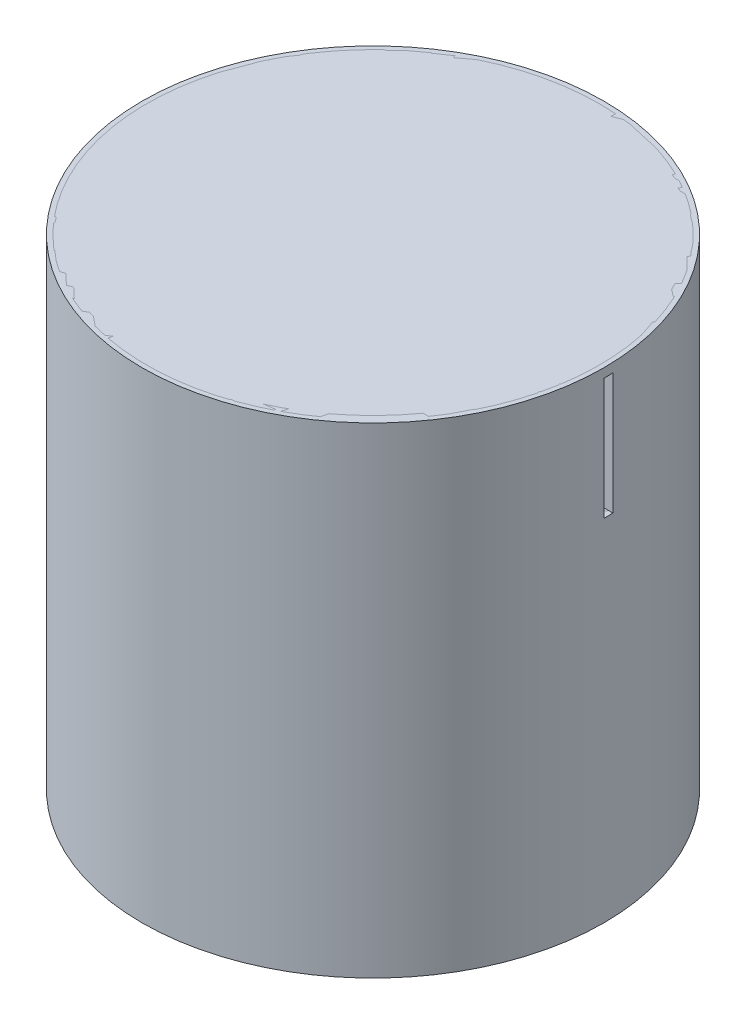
ISO-10303-21;
HEADER;
FILE_DESCRIPTION(('STEP AP214'),'2;1');
FILE_NAME('part.step','',(''),(''),'','','');
FILE_SCHEMA(('AUTOMOTIVE_DESIGN { 1 0 10303 214 1 1 1 1 }'));
ENDSEC;
DATA;
#1=APPLICATION_CONTEXT('core data for automotive mechanical design processes');
#2=APPLICATION_PROTOCOL_DEFINITION('international standard','automotive_design',2000,#1);
#3=PRODUCT_CONTEXT('',#1,'mechanical');
#4=PRODUCT('Part','Part','',(#3));
#5=PRODUCT_RELATED_PRODUCT_CATEGORY('part','',(#4));
#6=PRODUCT_DEFINITION_FORMATION('','',#4);
#7=PRODUCT_DEFINITION_CONTEXT('part definition',#1,'design');
#8=PRODUCT_DEFINITION('design','',#6,#7);
#9=PRODUCT_DEFINITION_SHAPE('','',#8);
#10=(LENGTH_UNIT() NAMED_UNIT(*) SI_UNIT(.MILLI.,.METRE.));
#11=(NAMED_UNIT(*) PLANE_ANGLE_UNIT() SI_UNIT($,.RADIAN.));
#12=(NAMED_UNIT(*) SI_UNIT($,.STERADIAN.) SOLID_ANGLE_UNIT());
#13=UNCERTAINTY_MEASURE_WITH_UNIT(LENGTH_MEASURE(1.E-05),#10,'distance_accuracy_value','');
#14=(GEOMETRIC_REPRESENTATION_CONTEXT(3) GLOBAL_UNCERTAINTY_ASSIGNED_CONTEXT((#13)) GLOBAL_UNIT_ASSIGNED_CONTEXT((#10,
#11,#12)) REPRESENTATION_CONTEXT('',''));
#15=CARTESIAN_POINT('',(0.,0.,0.));
#16=DIRECTION('',(0.,0.,1.));
#17=DIRECTION('',(1.,0.,0.));
#18=AXIS2_PLACEMENT_3D('',#15,#16,#17);
#19=CARTESIAN_POINT('',(0.,0.,0.));
#20=DIRECTION('',(0.,1.,0.));
#21=DIRECTION('',(-1.,0.,0.));
#22=AXIS2_PLACEMENT_3D('',#19,#20,#21);
#23=PLANE('',#22);
#24=CARTESIAN_POINT('',(0.,0.,0.));
#25=DIRECTION('',(0.,1.,0.));
#26=DIRECTION('',(-1.,0.,0.));
#27=AXIS2_PLACEMENT_3D('',#24,#25,#26);
#28=CIRCLE('',#27,59.7);
#29=CARTESIAN_POINT('',(-59.7,0.,0.));
#30=VERTEX_POINT('',#29);
#31=EDGE_CURVE('E11',#30,#30,#28,.T.);
#32=ORIENTED_EDGE('',*,*,#31,.F.);
#33=EDGE_LOOP('',(#32));
#34=FACE_BOUND('',#33,.T.);
#35=ADVANCED_FACE('F52',(#34),#23,.F.);
#36=CARTESIAN_POINT('',(0.,2.4,0.));
#37=DIRECTION('',(0.,1.,0.));
#38=DIRECTION('',(-1.,0.,0.));
#39=AXIS2_PLACEMENT_3D('',#36,#37,#38);
#40=CYLINDRICAL_SURFACE('',#39,59.7);
#41=ORIENTED_EDGE('',*,*,#31,.T.);
#42=EDGE_LOOP('',(#41));
#43=FACE_BOUND('',#42,.T.);
#44=CARTESIAN_POINT('',(0.,2.40000000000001,0.));
#45=DIRECTION('',(0.,1.,0.));
#46=DIRECTION('',(-1.,0.,0.));
#47=AXIS2_PLACEMENT_3D('',#44,#45,#46);
#48=CIRCLE('',#47,59.7);
#49=CARTESIAN_POINT('',(-59.7,2.40000000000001,0.));
#50=VERTEX_POINT('',#49);
#51=EDGE_CURVE('E58',#50,#50,#48,.T.);
#52=ORIENTED_EDGE('',*,*,#51,.F.);
#53=EDGE_LOOP('',(#52));
#54=FACE_BOUND('',#53,.T.);
#55=ADVANCED_FACE('F66',(#43,#54),#40,.T.);
#56=CARTESIAN_POINT('',(0.,2.40000000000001,0.));
#57=DIRECTION('',(0.,-1.,0.));
#58=DIRECTION('',(1.,0.,0.));
#59=AXIS2_PLACEMENT_3D('',#56,#57,#58);
#60=PLANE('',#59);
#61=ORIENTED_EDGE('',*,*,#51,.T.);
#62=EDGE_LOOP('',(#61));
#63=FACE_BOUND('',#62,.T.);
#64=ADVANCED_FACE('F64',(#63),#60,.F.);
#65=CLOSED_SHELL('',(#35,#55,#64));
#66=MANIFOLD_SOLID_BREP('B2_NOT_SHOWN',#65);
#67=CARTESIAN_POINT('',(0.,35.6,0.));
#68=DIRECTION('',(0.,-1.,0.));
#69=DIRECTION('',(0.,0.,-1.));
#70=AXIS2_PLACEMENT_3D('',#67,#68,#69);
#71=PLANE('',#70);
#72=CARTESIAN_POINT('',(0.,35.6,0.));
#73=DIRECTION('',(0.,-1.,0.));
#74=DIRECTION('',(0.,0.,-1.));
#75=AXIS2_PLACEMENT_3D('',#72,#73,#74);
#76=CIRCLE('',#75,20.75);
#77=CARTESIAN_POINT('',(0.,35.6,-20.75));
#78=VERTEX_POINT('',#77);
#79=EDGE_CURVE('E51',#78,#78,#76,.T.);
#80=ORIENTED_EDGE('',*,*,#79,.T.);
#81=EDGE_LOOP('',(#80));
#82=FACE_BOUND('',#81,.T.);
#83=ADVANCED_FACE('F100',(#82),#71,.T.);
#84=CARTESIAN_POINT('',(0.,14.4,0.));
#85=DIRECTION('',(0.,-1.,0.));
#86=DIRECTION('',(0.,0.,-1.));
#87=AXIS2_PLACEMENT_3D('',#84,#85,#86);
#88=CYLINDRICAL_SURFACE('',#87,20.75);
#89=CARTESIAN_POINT('',(0.,34.4,0.));
#90=DIRECTION('',(0.,-1.,0.));
#91=DIRECTION('',(0.,0.,-1.));
#92=AXIS2_PLACEMENT_3D('',#89,#90,#91);
#93=CIRCLE('',#92,20.75);
#94=CARTESIAN_POINT('',(0.,34.4,-20.75));
#95=VERTEX_POINT('',#94);
#96=EDGE_CURVE('E106',#95,#95,#93,.T.);
#97=ORIENTED_EDGE('',*,*,#96,.T.);
#98=EDGE_LOOP('',(#97));
#99=FACE_BOUND('',#98,.T.);
#100=ORIENTED_EDGE('',*,*,#79,.F.);
#101=EDGE_LOOP('',(#100));
#102=FACE_BOUND('',#101,.T.);
#103=ADVANCED_FACE('F133',(#99,#102),#88,.F.);
#104=CARTESIAN_POINT('',(0.,34.4,0.));
#105=DIRECTION('',(0.,-1.,0.));
#106=DIRECTION('',(0.,0.,-1.));
#107=AXIS2_PLACEMENT_3D('',#104,#105,#106);
#108=PLANE('',#107);
#109=CARTESIAN_POINT('',(0.,34.4,0.));
#110=DIRECTION('',(0.,-1.,0.));
#111=DIRECTION('',(0.,0.,-1.));
#112=AXIS2_PLACEMENT_3D('',#109,#110,#111);
#113=CIRCLE('',#112,59.7);
#114=CARTESIAN_POINT('',(0.,34.4,-59.7));
#115=VERTEX_POINT('',#114);
#116=EDGE_CURVE('E110',#115,#115,#113,.T.);
#117=ORIENTED_EDGE('',*,*,#116,.T.);
#118=EDGE_LOOP('',(#117));
#119=FACE_BOUND('',#118,.T.);
#120=ORIENTED_EDGE('',*,*,#96,.F.);
#121=EDGE_LOOP('',(#120));
#122=FACE_BOUND('',#121,.T.);
#123=ADVANCED_FACE('F129',(#119,#122),#108,.T.);
#124=CARTESIAN_POINT('',(0.,14.4,0.));
#125=DIRECTION('',(0.,-1.,0.));
#126=DIRECTION('',(0.,0.,-1.));
#127=AXIS2_PLACEMENT_3D('',#124,#125,#126);
#128=CYLINDRICAL_SURFACE('',#127,59.7);
#129=ORIENTED_EDGE('',*,*,#116,.F.);
#130=EDGE_LOOP('',(#129));
#131=FACE_BOUND('',#130,.T.);
#132=CARTESIAN_POINT('',(0.,36.8,0.));
#133=DIRECTION('',(0.,-1.,0.));
#134=DIRECTION('',(0.,0.,-1.));
#135=AXIS2_PLACEMENT_3D('',#132,#133,#134);
#136=CIRCLE('',#135,59.7);
#137=CARTESIAN_POINT('',(0.,36.8,-59.7));
#138=VERTEX_POINT('',#137);
#139=EDGE_CURVE('E114',#138,#138,#136,.T.);
#140=ORIENTED_EDGE('',*,*,#139,.T.);
#141=EDGE_LOOP('',(#140));
#142=FACE_BOUND('',#141,.T.);
#143=ADVANCED_FACE('F120',(#131,#142),#128,.T.);
#144=CARTESIAN_POINT('',(0.,36.8,0.));
#145=DIRECTION('',(0.,1.,0.));
#146=DIRECTION('',(0.,0.,1.));
#147=AXIS2_PLACEMENT_3D('',#144,#145,#146);
#148=PLANE('',#147);
#149=ORIENTED_EDGE('',*,*,#139,.F.);
#150=EDGE_LOOP('',(#149));
#151=FACE_BOUND('',#150,.T.);
#152=ADVANCED_FACE('F122',(#151),#148,.T.);
#153=CLOSED_SHELL('',(#83,#103,#123,#143,#152));
#154=MANIFOLD_SOLID_BREP('B6_NOT_SHOWN',#153);
#155=CARTESIAN_POINT('',(0.,36.8,0.));
#156=DIRECTION('',(0.,1.,0.));
#157=DIRECTION('',(-1.,0.,0.));
#158=AXIS2_PLACEMENT_3D('',#155,#156,#157);
#159=CYLINDRICAL_SURFACE('',#158,20.75);
#160=CARTESIAN_POINT('',(0.,34.4,0.));
#161=DIRECTION('',(0.,1.,0.));
#162=DIRECTION('',(-1.,0.,0.));
#163=AXIS2_PLACEMENT_3D('',#160,#161,#162);
#164=CIRCLE('',#163,20.75);
#165=CARTESIAN_POINT('',(-20.75,34.4,0.));
#166=VERTEX_POINT('',#165);
#167=EDGE_CURVE('E185',#166,#166,#164,.T.);
#168=ORIENTED_EDGE('',*,*,#167,.T.);
#169=EDGE_LOOP('',(#168));
#170=FACE_BOUND('',#169,.T.);
#171=CARTESIAN_POINT('',(0.,35.6,0.));
#172=DIRECTION('',(0.,1.,0.));
#173=DIRECTION('',(-1.,0.,0.));
#174=AXIS2_PLACEMENT_3D('',#171,#172,#173);
#175=CIRCLE('',#174,20.75);
#176=CARTESIAN_POINT('',(-20.75,35.6,0.));
#177=VERTEX_POINT('',#176);
#178=EDGE_CURVE('E99',#177,#177,#175,.T.);
#179=ORIENTED_EDGE('',*,*,#178,.F.);
#180=EDGE_LOOP('',(#179));
#181=FACE_BOUND('',#180,.T.);
#182=ADVANCED_FACE('F179',(#170,#181),#159,.T.);
#183=CARTESIAN_POINT('',(0.,35.6,0.));
#184=DIRECTION('',(0.,1.,0.));
#185=DIRECTION('',(-1.,0.,0.));
#186=AXIS2_PLACEMENT_3D('',#183,#184,#185);
#187=PLANE('',#186);
#188=ORIENTED_EDGE('',*,*,#178,.T.);
#189=EDGE_LOOP('',(#188));
#190=FACE_BOUND('',#189,.T.);
#191=ADVANCED_FACE('F195',(#190),#187,.T.);
#192=CARTESIAN_POINT('',(0.,34.4,0.));
#193=DIRECTION('',(0.,1.,0.));
#194=DIRECTION('',(-1.,0.,0.));
#195=AXIS2_PLACEMENT_3D('',#192,#193,#194);
#196=PLANE('',#195);
#197=ORIENTED_EDGE('',*,*,#167,.F.);
#198=EDGE_LOOP('',(#197));
#199=FACE_BOUND('',#198,.T.);
#200=ADVANCED_FACE('F193',(#199),#196,.F.);
#201=CLOSED_SHELL('',(#182,#191,#200));
#202=MANIFOLD_SOLID_BREP('B46_NOT_SHOWN',#201);
#203=CARTESIAN_POINT('',(0.,14.4,0.));
#204=DIRECTION('',(0.,-1.,0.));
#205=DIRECTION('',(0.,0.,-1.));
#206=AXIS2_PLACEMENT_3D('',#203,#204,#205);
#207=CYLINDRICAL_SURFACE('',#206,58.5);
#208=CARTESIAN_POINT('',(0.,-90.,0.));
#209=DIRECTION('',(0.,-1.,0.));
#210=DIRECTION('',(0.,0.,-1.));
#211=AXIS2_PLACEMENT_3D('',#208,#209,#210);
#212=CIRCLE('',#211,58.5);
#213=CARTESIAN_POINT('',(0.,-90.,-58.5));
#214=VERTEX_POINT('',#213);
#215=EDGE_CURVE('E177',#214,#214,#212,.T.);
#216=ORIENTED_EDGE('',*,*,#215,.T.);
#217=EDGE_LOOP('',(#216));
#218=FACE_BOUND('',#217,.T.);
#219=CARTESIAN_POINT('',(0.,36.8,0.));
#220=DIRECTION('',(0.,-1.,0.));
#221=DIRECTION('',(0.,0.,-1.));
#222=AXIS2_PLACEMENT_3D('',#219,#220,#221);
#223=CIRCLE('',#222,58.5);
#224=CARTESIAN_POINT('',(0.,36.8,-58.5));
#225=VERTEX_POINT('',#224);
#226=EDGE_CURVE('E287',#225,#225,#223,.T.);
#227=ORIENTED_EDGE('',*,*,#226,.F.);
#228=EDGE_LOOP('',(#227));
#229=FACE_BOUND('',#228,.T.);
#230=CARTESIAN_POINT('',(0.,2.40000000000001,0.));
#231=DIRECTION('',(0.,-1.,0.));
#232=DIRECTION('',(1.,0.,0.));
#233=AXIS2_PLACEMENT_3D('',#230,#231,#232);
#234=CIRCLE('',#233,58.5);
#235=CARTESIAN_POINT('',(58.5,2.4,0.));
#236=VERTEX_POINT('',#235);
#237=CARTESIAN_POINT('',(58.4507484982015,2.4,-2.4));
#238=VERTEX_POINT('',#237);
#239=EDGE_CURVE('E234',#236,#238,#234,.F.);
#240=ORIENTED_EDGE('',*,*,#239,.T.);
#241=DIRECTION('',(0.,1.,0.));
#242=VECTOR('',#241,1.);
#243=CARTESIAN_POINT('',(58.4507484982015,-1.02911547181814,-2.4));
#244=LINE('',#243,#242);
#245=CARTESIAN_POINT('',(58.4507484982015,34.4,-2.4));
#246=VERTEX_POINT('',#245);
#247=EDGE_CURVE('E268',#238,#246,#244,.T.);
#248=ORIENTED_EDGE('',*,*,#247,.T.);
#249=CARTESIAN_POINT('',(0.,34.4,0.));
#250=DIRECTION('',(0.,-1.,0.));
#251=DIRECTION('',(0.,0.,-1.));
#252=AXIS2_PLACEMENT_3D('',#249,#250,#251);
#253=CIRCLE('',#252,58.5);
#254=CARTESIAN_POINT('',(58.5,34.4,0.));
#255=VERTEX_POINT('',#254);
#256=EDGE_CURVE('E324',#255,#246,#253,.F.);
#257=ORIENTED_EDGE('',*,*,#256,.F.);
#258=DIRECTION('',(0.,1.,0.));
#259=VECTOR('',#258,1.);
#260=CARTESIAN_POINT('',(58.5,-1.02911547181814,0.));
#261=LINE('',#260,#259);
#262=EDGE_CURVE('E328',#236,#255,#261,.T.);
#263=ORIENTED_EDGE('',*,*,#262,.F.);
#264=EDGE_LOOP('',(#240,#248,#257,#263));
#265=FACE_BOUND('',#264,.T.);
#266=ADVANCED_FACE('F220',(#218,#229,#265),#207,.F.);
#267=CARTESIAN_POINT('',(0.,14.4,0.));
#268=DIRECTION('',(0.,-1.,0.));
#269=DIRECTION('',(0.,0.,-1.));
#270=AXIS2_PLACEMENT_3D('',#267,#268,#269);
#271=CYLINDRICAL_SURFACE('',#270,60.9);
#272=CARTESIAN_POINT('',(0.,36.8,0.));
#273=DIRECTION('',(0.,-1.,0.));
#274=DIRECTION('',(0.,0.,-1.));
#275=AXIS2_PLACEMENT_3D('',#272,#273,#274);
#276=CIRCLE('',#275,60.9);
#277=CARTESIAN_POINT('',(0.,36.8,-60.9));
#278=VERTEX_POINT('',#277);
#279=EDGE_CURVE('E290',#278,#278,#276,.T.);
#280=ORIENTED_EDGE('',*,*,#279,.T.);
#281=EDGE_LOOP('',(#280));
#282=FACE_BOUND('',#281,.T.);
#283=CARTESIAN_POINT('',(0.,-90.,0.));
#284=DIRECTION('',(0.,-1.,0.));
#285=DIRECTION('',(0.,0.,-1.));
#286=AXIS2_PLACEMENT_3D('',#283,#284,#285);
#287=CIRCLE('',#286,60.9);
#288=CARTESIAN_POINT('',(0.,-90.,-60.9));
#289=VERTEX_POINT('',#288);
#290=EDGE_CURVE('E227',#289,#289,#287,.T.);
#291=ORIENTED_EDGE('',*,*,#290,.F.);
#292=EDGE_LOOP('',(#291));
#293=FACE_BOUND('',#292,.T.);
#294=CARTESIAN_POINT('',(0.,34.4,0.));
#295=DIRECTION('',(0.,-1.,0.));
#296=DIRECTION('',(0.,0.,-1.));
#297=AXIS2_PLACEMENT_3D('',#294,#295,#296);
#298=CIRCLE('',#297,60.9);
#299=CARTESIAN_POINT('',(60.9,34.4,0.));
#300=VERTEX_POINT('',#299);
#301=CARTESIAN_POINT('',(60.8526909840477,34.4,-2.4));
#302=VERTEX_POINT('',#301);
#303=EDGE_CURVE('E242',#300,#302,#298,.F.);
#304=ORIENTED_EDGE('',*,*,#303,.T.);
#305=DIRECTION('',(0.,1.,0.));
#306=VECTOR('',#305,1.);
#307=CARTESIAN_POINT('',(60.8526909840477,-1.02911547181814,-2.4));
#308=LINE('',#307,#306);
#309=CARTESIAN_POINT('',(60.8526909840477,2.4,-2.4));
#310=VERTEX_POINT('',#309);
#311=EDGE_CURVE('E266',#310,#302,#308,.T.);
#312=ORIENTED_EDGE('',*,*,#311,.F.);
#313=CARTESIAN_POINT('',(0.,2.40000000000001,0.));
#314=DIRECTION('',(0.,-1.,0.));
#315=DIRECTION('',(1.,0.,0.));
#316=AXIS2_PLACEMENT_3D('',#313,#314,#315);
#317=CIRCLE('',#316,60.9);
#318=CARTESIAN_POINT('',(60.9,2.4,0.));
#319=VERTEX_POINT('',#318);
#320=EDGE_CURVE('E272',#319,#310,#317,.F.);
#321=ORIENTED_EDGE('',*,*,#320,.F.);
#322=DIRECTION('',(0.,1.,0.));
#323=VECTOR('',#322,1.);
#324=CARTESIAN_POINT('',(60.9,-1.02911547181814,0.));
#325=LINE('',#324,#323);
#326=EDGE_CURVE('E285',#319,#300,#325,.T.);
#327=ORIENTED_EDGE('',*,*,#326,.T.);
#328=EDGE_LOOP('',(#304,#312,#321,#327));
#329=FACE_BOUND('',#328,.T.);
#330=ADVANCED_FACE('F279',(#282,#293,#329),#271,.T.);
#331=CARTESIAN_POINT('',(-5.2041704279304E-13,-90.,0.));
#332=DIRECTION('',(0.,-1.,0.));
#333=DIRECTION('',(0.,0.,-1.));
#334=AXIS2_PLACEMENT_3D('',#331,#332,#333);
#335=PLANE('',#334);
#336=ORIENTED_EDGE('',*,*,#290,.T.);
#337=EDGE_LOOP('',(#336));
#338=FACE_BOUND('',#337,.T.);
#339=ORIENTED_EDGE('',*,*,#215,.F.);
#340=EDGE_LOOP('',(#339));
#341=FACE_BOUND('',#340,.T.);
#342=ADVANCED_FACE('F295',(#338,#341),#335,.T.);
#343=CARTESIAN_POINT('',(0.,36.8,0.));
#344=DIRECTION('',(0.,1.,0.));
#345=DIRECTION('',(0.,0.,1.));
#346=AXIS2_PLACEMENT_3D('',#343,#344,#345);
#347=PLANE('',#346);
#348=ORIENTED_EDGE('',*,*,#226,.T.);
#349=EDGE_LOOP('',(#348));
#350=FACE_BOUND('',#349,.T.);
#351=ORIENTED_EDGE('',*,*,#279,.F.);
#352=EDGE_LOOP('',(#351));
#353=FACE_BOUND('',#352,.T.);
#354=ADVANCED_FACE('F306',(#350,#353),#347,.T.);
#355=CARTESIAN_POINT('',(0.,2.40000000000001,0.));
#356=DIRECTION('',(0.,-1.,0.));
#357=DIRECTION('',(1.,0.,0.));
#358=AXIS2_PLACEMENT_3D('',#355,#356,#357);
#359=PLANE('',#358);
#360=DIRECTION('',(1.,0.,0.));
#361=VECTOR('',#360,1.);
#362=CARTESIAN_POINT('',(0.,2.40000000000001,0.));
#363=LINE('',#362,#361);
#364=EDGE_CURVE('E274',#236,#319,#363,.T.);
#365=ORIENTED_EDGE('',*,*,#364,.T.);
#366=ORIENTED_EDGE('',*,*,#320,.T.);
#367=DIRECTION('',(1.,0.,0.));
#368=VECTOR('',#367,1.);
#369=CARTESIAN_POINT('',(0.,2.40000000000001,-2.4));
#370=LINE('',#369,#368);
#371=EDGE_CURVE('E261',#238,#310,#370,.T.);
#372=ORIENTED_EDGE('',*,*,#371,.F.);
#373=ORIENTED_EDGE('',*,*,#239,.F.);
#374=EDGE_LOOP('',(#365,#366,#372,#373));
#375=FACE_BOUND('',#374,.T.);
#376=ADVANCED_FACE('F273',(#375),#359,.F.);
#377=CARTESIAN_POINT('',(0.,34.4,0.));
#378=DIRECTION('',(0.,-1.,0.));
#379=DIRECTION('',(0.,0.,-1.));
#380=AXIS2_PLACEMENT_3D('',#377,#378,#379);
#381=PLANE('',#380);
#382=DIRECTION('',(1.,0.,0.));
#383=VECTOR('',#382,1.);
#384=CARTESIAN_POINT('',(0.,34.4,0.));
#385=LINE('',#384,#383);
#386=EDGE_CURVE('E269',#255,#300,#385,.T.);
#387=ORIENTED_EDGE('',*,*,#386,.F.);
#388=ORIENTED_EDGE('',*,*,#256,.T.);
#389=DIRECTION('',(1.,0.,0.));
#390=VECTOR('',#389,1.);
#391=CARTESIAN_POINT('',(0.,34.4,-2.4));
#392=LINE('',#391,#390);
#393=EDGE_CURVE('E281',#246,#302,#392,.T.);
#394=ORIENTED_EDGE('',*,*,#393,.T.);
#395=ORIENTED_EDGE('',*,*,#303,.F.);
#396=EDGE_LOOP('',(#387,#388,#394,#395));
#397=FACE_BOUND('',#396,.T.);
#398=ADVANCED_FACE('F313',(#397),#381,.T.);
#399=CARTESIAN_POINT('',(0.,-1.02911547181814,-2.4));
#400=DIRECTION('',(0.,0.,1.));
#401=DIRECTION('',(1.,0.,0.));
#402=AXIS2_PLACEMENT_3D('',#399,#400,#401);
#403=PLANE('',#402);
#404=ORIENTED_EDGE('',*,*,#371,.T.);
#405=ORIENTED_EDGE('',*,*,#311,.T.);
#406=ORIENTED_EDGE('',*,*,#393,.F.);
#407=ORIENTED_EDGE('',*,*,#247,.F.);
#408=EDGE_LOOP('',(#404,#405,#406,#407));
#409=FACE_BOUND('',#408,.T.);
#410=ADVANCED_FACE('F263',(#409),#403,.T.);
#411=CARTESIAN_POINT('',(0.,-1.02911547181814,0.));
#412=DIRECTION('',(0.,0.,1.));
#413=DIRECTION('',(1.,0.,0.));
#414=AXIS2_PLACEMENT_3D('',#411,#412,#413);
#415=PLANE('',#414);
#416=ORIENTED_EDGE('',*,*,#262,.T.);
#417=ORIENTED_EDGE('',*,*,#386,.T.);
#418=ORIENTED_EDGE('',*,*,#326,.F.);
#419=ORIENTED_EDGE('',*,*,#364,.F.);
#420=EDGE_LOOP('',(#416,#417,#418,#419));
#421=FACE_BOUND('',#420,.T.);
#422=ADVANCED_FACE('F316',(#421),#415,.F.);
#423=CLOSED_SHELL('',(#266,#330,#342,#354,#376,#398,#410,#422));
#424=MANIFOLD_SOLID_BREP('B94',#423);
#425=ADVANCED_BREP_SHAPE_REPRESENTATION('',(#18,#66,#154,#202,#424),#14);
#426=SHAPE_DEFINITION_REPRESENTATION(#9,#425);
ENDSEC;
END-ISO-10303-21;
